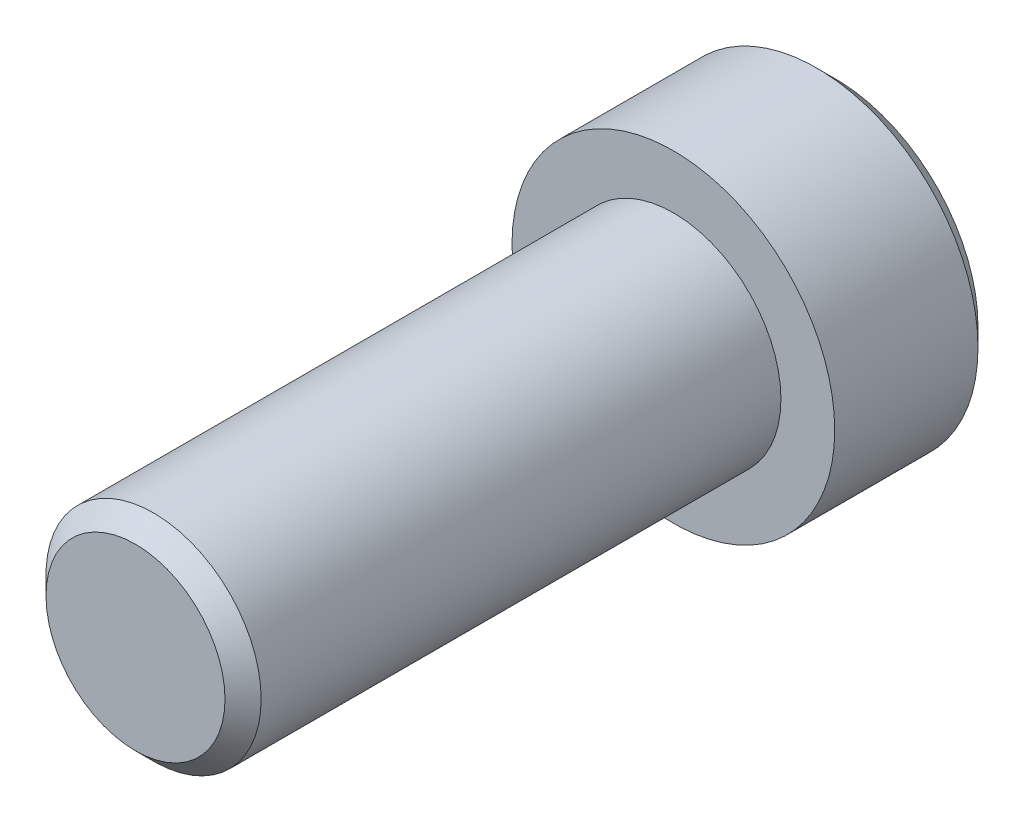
ISO-10303-21;
HEADER;
FILE_DESCRIPTION(('STEP AP214'),'2;1');
FILE_NAME('part.step','',(''),(''),'','','');
FILE_SCHEMA(('AUTOMOTIVE_DESIGN { 1 0 10303 214 1 1 1 1 }'));
ENDSEC;
DATA;
#1=APPLICATION_CONTEXT('core data for automotive mechanical design processes');
#2=APPLICATION_PROTOCOL_DEFINITION('international standard','automotive_design',2000,#1);
#3=PRODUCT_CONTEXT('',#1,'mechanical');
#4=PRODUCT('Part','Part','',(#3));
#5=PRODUCT_RELATED_PRODUCT_CATEGORY('part','',(#4));
#6=PRODUCT_DEFINITION_FORMATION('','',#4);
#7=PRODUCT_DEFINITION_CONTEXT('part definition',#1,'design');
#8=PRODUCT_DEFINITION('design','',#6,#7);
#9=PRODUCT_DEFINITION_SHAPE('','',#8);
#10=(LENGTH_UNIT() NAMED_UNIT(*) SI_UNIT(.MILLI.,.METRE.));
#11=(NAMED_UNIT(*) PLANE_ANGLE_UNIT() SI_UNIT($,.RADIAN.));
#12=(NAMED_UNIT(*) SI_UNIT($,.STERADIAN.) SOLID_ANGLE_UNIT());
#13=UNCERTAINTY_MEASURE_WITH_UNIT(LENGTH_MEASURE(1.E-05),#10,'distance_accuracy_value','');
#14=(GEOMETRIC_REPRESENTATION_CONTEXT(3) GLOBAL_UNCERTAINTY_ASSIGNED_CONTEXT((#13)) GLOBAL_UNIT_ASSIGNED_CONTEXT((#10,
#11,#12)) REPRESENTATION_CONTEXT('',''));
#15=CARTESIAN_POINT('',(0.,0.,0.));
#16=DIRECTION('',(0.,0.,1.));
#17=DIRECTION('',(1.,0.,0.));
#18=AXIS2_PLACEMENT_3D('',#15,#16,#17);
#19=CARTESIAN_POINT('',(0.,0.,15.875));
#20=DIRECTION('',(0.,0.,1.));
#21=DIRECTION('',(1.,0.,0.));
#22=AXIS2_PLACEMENT_3D('',#19,#20,#21);
#23=PLANE('',#22);
#24=CARTESIAN_POINT('',(0.,0.,15.875));
#25=DIRECTION('',(0.,0.,1.));
#26=DIRECTION('',(1.,0.,0.));
#27=AXIS2_PLACEMENT_3D('',#24,#25,#26);
#28=CIRCLE('',#27,2.6416);
#29=CARTESIAN_POINT('',(2.6416,0.,15.875));
#30=VERTEX_POINT('',#29);
#31=EDGE_CURVE('E40',#30,#30,#28,.T.);
#32=ORIENTED_EDGE('',*,*,#31,.T.);
#33=EDGE_LOOP('',(#32));
#34=FACE_BOUND('',#33,.T.);
#35=ADVANCED_FACE('F32',(#34),#23,.T.);
#36=CARTESIAN_POINT('',(0.,0.,15.875));
#37=DIRECTION('',(0.,0.,1.));
#38=DIRECTION('',(1.,0.,0.));
#39=AXIS2_PLACEMENT_3D('',#36,#37,#38);
#40=CYLINDRICAL_SURFACE('',#39,3.175);
#41=CARTESIAN_POINT('',(0.,0.,15.3416));
#42=DIRECTION('',(0.,0.,1.));
#43=DIRECTION('',(1.,0.,0.));
#44=AXIS2_PLACEMENT_3D('',#41,#42,#43);
#45=CIRCLE('',#44,3.175);
#46=CARTESIAN_POINT('',(3.175,0.,15.3416));
#47=VERTEX_POINT('',#46);
#48=EDGE_CURVE('E11',#47,#47,#45,.F.);
#49=ORIENTED_EDGE('',*,*,#48,.T.);
#50=EDGE_LOOP('',(#49));
#51=FACE_BOUND('',#50,.T.);
#52=CARTESIAN_POINT('',(0.,0.,0.));
#53=DIRECTION('',(0.,0.,1.));
#54=DIRECTION('',(1.,0.,0.));
#55=AXIS2_PLACEMENT_3D('',#52,#53,#54);
#56=CIRCLE('',#55,3.175);
#57=CARTESIAN_POINT('',(3.175,0.,0.));
#58=VERTEX_POINT('',#57);
#59=EDGE_CURVE('E142',#58,#58,#56,.T.);
#60=ORIENTED_EDGE('',*,*,#59,.T.);
#61=EDGE_LOOP('',(#60));
#62=FACE_BOUND('',#61,.T.);
#63=ADVANCED_FACE('F163',(#51,#62),#40,.T.);
#64=CARTESIAN_POINT('',(3.175,0.,0.));
#65=DIRECTION('',(0.,0.,1.));
#66=DIRECTION('',(1.,0.,0.));
#67=AXIS2_PLACEMENT_3D('',#64,#65,#66);
#68=PLANE('',#67);
#69=CARTESIAN_POINT('',(0.,0.,0.));
#70=DIRECTION('',(0.,0.,1.));
#71=DIRECTION('',(1.,0.,0.));
#72=AXIS2_PLACEMENT_3D('',#69,#70,#71);
#73=CIRCLE('',#72,4.7625);
#74=CARTESIAN_POINT('',(4.7625,0.,0.));
#75=VERTEX_POINT('',#74);
#76=EDGE_CURVE('E134',#75,#75,#73,.T.);
#77=ORIENTED_EDGE('',*,*,#76,.T.);
#78=EDGE_LOOP('',(#77));
#79=FACE_BOUND('',#78,.T.);
#80=ORIENTED_EDGE('',*,*,#59,.F.);
#81=EDGE_LOOP('',(#80));
#82=FACE_BOUND('',#81,.T.);
#83=ADVANCED_FACE('F168',(#79,#82),#68,.T.);
#84=CARTESIAN_POINT('',(0.,0.,15.875));
#85=DIRECTION('',(0.,0.,1.));
#86=DIRECTION('',(1.,0.,0.));
#87=AXIS2_PLACEMENT_3D('',#84,#85,#86);
#88=CYLINDRICAL_SURFACE('',#87,4.7625);
#89=CARTESIAN_POINT('',(0.,0.,-4.22909999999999));
#90=DIRECTION('',(0.,0.,-1.));
#91=DIRECTION('',(-1.,0.,0.));
#92=AXIS2_PLACEMENT_3D('',#89,#90,#91);
#93=CIRCLE('',#92,4.7625);
#94=CARTESIAN_POINT('',(-4.7625,0.,-4.22909999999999));
#95=VERTEX_POINT('',#94);
#96=EDGE_CURVE('E145',#95,#95,#93,.F.);
#97=ORIENTED_EDGE('',*,*,#96,.T.);
#98=EDGE_LOOP('',(#97));
#99=FACE_BOUND('',#98,.T.);
#100=ORIENTED_EDGE('',*,*,#76,.F.);
#101=EDGE_LOOP('',(#100));
#102=FACE_BOUND('',#101,.T.);
#103=ADVANCED_FACE('F174',(#99,#102),#88,.T.);
#104=CARTESIAN_POINT('',(4.7625,0.,-4.7625));
#105=DIRECTION('',(0.,0.,-1.));
#106=DIRECTION('',(-1.,0.,0.));
#107=AXIS2_PLACEMENT_3D('',#104,#105,#106);
#108=PLANE('',#107);
#109=CARTESIAN_POINT('',(0.,0.,-4.7625));
#110=DIRECTION('',(0.,0.,-1.));
#111=DIRECTION('',(-1.,0.,0.));
#112=AXIS2_PLACEMENT_3D('',#109,#110,#111);
#113=CIRCLE('',#112,4.2291);
#114=CARTESIAN_POINT('',(-4.22909999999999,0.,-4.7625));
#115=VERTEX_POINT('',#114);
#116=EDGE_CURVE('E148',#115,#115,#113,.T.);
#117=ORIENTED_EDGE('',*,*,#116,.T.);
#118=EDGE_LOOP('',(#117));
#119=FACE_BOUND('',#118,.T.);
#120=DIRECTION('',(0.00412520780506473,-0.999991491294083,0.));
#121=VECTOR('',#120,1.);
#122=CARTESIAN_POINT('',(2.37555833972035,1.38462678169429,-4.7625));
#123=LINE('',#122,#121);
#124=CARTESIAN_POINT('',(2.37555833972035,1.38462678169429,-4.7625));
#125=VERTEX_POINT('',#124);
#126=CARTESIAN_POINT('',(2.38690113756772,-1.36498047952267,-4.7625));
#127=VERTEX_POINT('',#126);
#128=EDGE_CURVE('E47',#125,#127,#123,.T.);
#129=ORIENTED_EDGE('',*,*,#128,.F.);
#130=DIRECTION('',(0.868080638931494,-0.496423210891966,0.));
#131=VECTOR('',#130,1.);
#132=CARTESIAN_POINT('',(-0.0113427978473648,2.74960726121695,-4.7625));
#133=LINE('',#132,#131);
#134=CARTESIAN_POINT('',(-0.0113427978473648,2.74960726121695,-4.7625));
#135=VERTEX_POINT('',#134);
#136=EDGE_CURVE('E130',#135,#125,#133,.T.);
#137=ORIENTED_EDGE('',*,*,#136,.F.);
#138=DIRECTION('',(0.863955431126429,0.503568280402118,0.));
#139=VECTOR('',#138,1.);
#140=CARTESIAN_POINT('',(-2.38690113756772,1.36498047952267,-4.7625));
#141=LINE('',#140,#139);
#142=CARTESIAN_POINT('',(-2.38690113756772,1.36498047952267,-4.7625));
#143=VERTEX_POINT('',#142);
#144=EDGE_CURVE('E128',#143,#135,#141,.T.);
#145=ORIENTED_EDGE('',*,*,#144,.F.);
#146=DIRECTION('',(-0.00412520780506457,0.999991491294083,0.));
#147=VECTOR('',#146,1.);
#148=CARTESIAN_POINT('',(-2.37555833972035,-1.38462678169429,-4.7625));
#149=LINE('',#148,#147);
#150=CARTESIAN_POINT('',(-2.37555833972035,-1.38462678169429,-4.7625));
#151=VERTEX_POINT('',#150);
#152=EDGE_CURVE('E95',#151,#143,#149,.T.);
#153=ORIENTED_EDGE('',*,*,#152,.F.);
#154=DIRECTION('',(-0.868080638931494,0.496423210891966,0.));
#155=VECTOR('',#154,1.);
#156=CARTESIAN_POINT('',(0.0113427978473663,-2.74960726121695,-4.7625));
#157=LINE('',#156,#155);
#158=CARTESIAN_POINT('',(0.0113427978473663,-2.74960726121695,-4.7625));
#159=VERTEX_POINT('',#158);
#160=EDGE_CURVE('E124',#159,#151,#157,.T.);
#161=ORIENTED_EDGE('',*,*,#160,.F.);
#162=DIRECTION('',(-0.863955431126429,-0.503568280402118,0.));
#163=VECTOR('',#162,1.);
#164=CARTESIAN_POINT('',(2.38690113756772,-1.36498047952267,-4.7625));
#165=LINE('',#164,#163);
#166=EDGE_CURVE('E121',#127,#159,#165,.T.);
#167=ORIENTED_EDGE('',*,*,#166,.F.);
#168=EDGE_LOOP('',(#129,#137,#145,#153,#161,#167));
#169=FACE_BOUND('',#168,.T.);
#170=ADVANCED_FACE('F178',(#119,#169),#108,.T.);
#171=CARTESIAN_POINT('',(2.37555833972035,1.38462678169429,-0.0635000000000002));
#172=DIRECTION('',(0.999991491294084,0.00412520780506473,0.));
#173=DIRECTION('',(-0.00412520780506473,0.999991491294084,0.));
#174=AXIS2_PLACEMENT_3D('',#171,#172,#173);
#175=PLANE('',#174);
#176=ORIENTED_EDGE('',*,*,#128,.T.);
#177=DIRECTION('',(0.,0.,-1.));
#178=VECTOR('',#177,1.);
#179=CARTESIAN_POINT('',(2.38690113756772,-1.36498047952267,-0.0635000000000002));
#180=LINE('',#179,#178);
#181=CARTESIAN_POINT('',(2.38690113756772,-1.36498047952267,-0.0635000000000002));
#182=VERTEX_POINT('',#181);
#183=EDGE_CURVE('E77',#182,#127,#180,.T.);
#184=ORIENTED_EDGE('',*,*,#183,.F.);
#185=DIRECTION('',(0.00412520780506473,-0.999991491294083,0.));
#186=VECTOR('',#185,1.);
#187=CARTESIAN_POINT('',(2.37555833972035,1.38462678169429,-0.0635000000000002));
#188=LINE('',#187,#186);
#189=CARTESIAN_POINT('',(2.37555833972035,1.38462678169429,-0.0635000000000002));
#190=VERTEX_POINT('',#189);
#191=EDGE_CURVE('E132',#190,#182,#188,.T.);
#192=ORIENTED_EDGE('',*,*,#191,.F.);
#193=DIRECTION('',(0.,0.,-1.));
#194=VECTOR('',#193,1.);
#195=CARTESIAN_POINT('',(2.37555833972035,1.38462678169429,-0.0635000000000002));
#196=LINE('',#195,#194);
#197=EDGE_CURVE('E55',#190,#125,#196,.T.);
#198=ORIENTED_EDGE('',*,*,#197,.T.);
#199=EDGE_LOOP('',(#176,#184,#192,#198));
#200=FACE_BOUND('',#199,.T.);
#201=ADVANCED_FACE('F182',(#200),#175,.F.);
#202=CARTESIAN_POINT('',(-0.0113427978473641,2.74960726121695,-0.0635000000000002));
#203=DIRECTION('',(0.496423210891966,0.868080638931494,0.));
#204=DIRECTION('',(-0.868080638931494,0.496423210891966,0.));
#205=AXIS2_PLACEMENT_3D('',#202,#203,#204);
#206=PLANE('',#205);
#207=ORIENTED_EDGE('',*,*,#136,.T.);
#208=ORIENTED_EDGE('',*,*,#197,.F.);
#209=DIRECTION('',(0.868080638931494,-0.496423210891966,0.));
#210=VECTOR('',#209,1.);
#211=CARTESIAN_POINT('',(-0.0113427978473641,2.74960726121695,-0.0635000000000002));
#212=LINE('',#211,#210);
#213=CARTESIAN_POINT('',(-0.0113427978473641,2.74960726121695,-0.0635000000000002));
#214=VERTEX_POINT('',#213);
#215=EDGE_CURVE('E107',#214,#190,#212,.T.);
#216=ORIENTED_EDGE('',*,*,#215,.F.);
#217=DIRECTION('',(0.,0.,-1.));
#218=VECTOR('',#217,1.);
#219=CARTESIAN_POINT('',(-0.0113427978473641,2.74960726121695,-0.0635000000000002));
#220=LINE('',#219,#218);
#221=EDGE_CURVE('E99',#214,#135,#220,.T.);
#222=ORIENTED_EDGE('',*,*,#221,.T.);
#223=EDGE_LOOP('',(#207,#208,#216,#222));
#224=FACE_BOUND('',#223,.T.);
#225=ADVANCED_FACE('F186',(#224),#206,.F.);
#226=CARTESIAN_POINT('',(-2.38690113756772,1.36498047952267,-0.0635000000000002));
#227=DIRECTION('',(-0.503568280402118,0.863955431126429,0.));
#228=DIRECTION('',(-0.863955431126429,-0.503568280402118,0.));
#229=AXIS2_PLACEMENT_3D('',#226,#227,#228);
#230=PLANE('',#229);
#231=ORIENTED_EDGE('',*,*,#144,.T.);
#232=ORIENTED_EDGE('',*,*,#221,.F.);
#233=DIRECTION('',(0.863955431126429,0.503568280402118,0.));
#234=VECTOR('',#233,1.);
#235=CARTESIAN_POINT('',(-2.38690113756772,1.36498047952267,-0.0635000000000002));
#236=LINE('',#235,#234);
#237=CARTESIAN_POINT('',(-2.38690113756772,1.36498047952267,-0.0635000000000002));
#238=VERTEX_POINT('',#237);
#239=EDGE_CURVE('E103',#238,#214,#236,.T.);
#240=ORIENTED_EDGE('',*,*,#239,.F.);
#241=DIRECTION('',(0.,0.,-1.));
#242=VECTOR('',#241,1.);
#243=CARTESIAN_POINT('',(-2.38690113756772,1.36498047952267,-0.0635000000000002));
#244=LINE('',#243,#242);
#245=EDGE_CURVE('E88',#238,#143,#244,.T.);
#246=ORIENTED_EDGE('',*,*,#245,.T.);
#247=EDGE_LOOP('',(#231,#232,#240,#246));
#248=FACE_BOUND('',#247,.T.);
#249=ADVANCED_FACE('F104',(#248),#230,.F.);
#250=CARTESIAN_POINT('',(-2.37555833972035,-1.38462678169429,-0.0635000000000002));
#251=DIRECTION('',(-0.999991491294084,-0.00412520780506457,0.));
#252=DIRECTION('',(0.00412520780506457,-0.999991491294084,0.));
#253=AXIS2_PLACEMENT_3D('',#250,#251,#252);
#254=PLANE('',#253);
#255=ORIENTED_EDGE('',*,*,#152,.T.);
#256=ORIENTED_EDGE('',*,*,#245,.F.);
#257=DIRECTION('',(-0.00412520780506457,0.999991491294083,0.));
#258=VECTOR('',#257,1.);
#259=CARTESIAN_POINT('',(-2.37555833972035,-1.38462678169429,-0.0635000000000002));
#260=LINE('',#259,#258);
#261=CARTESIAN_POINT('',(-2.37555833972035,-1.38462678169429,-0.0635000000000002));
#262=VERTEX_POINT('',#261);
#263=EDGE_CURVE('E92',#262,#238,#260,.T.);
#264=ORIENTED_EDGE('',*,*,#263,.F.);
#265=DIRECTION('',(0.,0.,-1.));
#266=VECTOR('',#265,1.);
#267=CARTESIAN_POINT('',(-2.37555833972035,-1.38462678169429,-0.0635000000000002));
#268=LINE('',#267,#266);
#269=EDGE_CURVE('E100',#262,#151,#268,.T.);
#270=ORIENTED_EDGE('',*,*,#269,.T.);
#271=EDGE_LOOP('',(#255,#256,#264,#270));
#272=FACE_BOUND('',#271,.T.);
#273=ADVANCED_FACE('F90',(#272),#254,.F.);
#274=CARTESIAN_POINT('',(0.011342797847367,-2.74960726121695,-0.0635000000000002));
#275=DIRECTION('',(-0.496423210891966,-0.868080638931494,0.));
#276=DIRECTION('',(0.868080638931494,-0.496423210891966,0.));
#277=AXIS2_PLACEMENT_3D('',#274,#275,#276);
#278=PLANE('',#277);
#279=ORIENTED_EDGE('',*,*,#160,.T.);
#280=ORIENTED_EDGE('',*,*,#269,.F.);
#281=DIRECTION('',(-0.868080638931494,0.496423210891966,0.));
#282=VECTOR('',#281,1.);
#283=CARTESIAN_POINT('',(0.011342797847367,-2.74960726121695,-0.0635000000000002));
#284=LINE('',#283,#282);
#285=CARTESIAN_POINT('',(0.011342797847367,-2.74960726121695,-0.0635000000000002));
#286=VERTEX_POINT('',#285);
#287=EDGE_CURVE('E113',#286,#262,#284,.T.);
#288=ORIENTED_EDGE('',*,*,#287,.F.);
#289=DIRECTION('',(0.,0.,-1.));
#290=VECTOR('',#289,1.);
#291=CARTESIAN_POINT('',(0.011342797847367,-2.74960726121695,-0.0635000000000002));
#292=LINE('',#291,#290);
#293=EDGE_CURVE('E137',#286,#159,#292,.T.);
#294=ORIENTED_EDGE('',*,*,#293,.T.);
#295=EDGE_LOOP('',(#279,#280,#288,#294));
#296=FACE_BOUND('',#295,.T.);
#297=ADVANCED_FACE('F190',(#296),#278,.F.);
#298=CARTESIAN_POINT('',(2.38690113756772,-1.36498047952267,-0.0635000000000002));
#299=DIRECTION('',(0.503568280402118,-0.863955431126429,0.));
#300=DIRECTION('',(0.863955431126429,0.503568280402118,0.));
#301=AXIS2_PLACEMENT_3D('',#298,#299,#300);
#302=PLANE('',#301);
#303=ORIENTED_EDGE('',*,*,#166,.T.);
#304=ORIENTED_EDGE('',*,*,#293,.F.);
#305=DIRECTION('',(-0.863955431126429,-0.503568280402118,0.));
#306=VECTOR('',#305,1.);
#307=CARTESIAN_POINT('',(2.38690113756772,-1.36498047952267,-0.0635000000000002));
#308=LINE('',#307,#306);
#309=EDGE_CURVE('E115',#182,#286,#308,.T.);
#310=ORIENTED_EDGE('',*,*,#309,.F.);
#311=ORIENTED_EDGE('',*,*,#183,.T.);
#312=EDGE_LOOP('',(#303,#304,#310,#311));
#313=FACE_BOUND('',#312,.T.);
#314=ADVANCED_FACE('F187',(#313),#302,.F.);
#315=CARTESIAN_POINT('',(2.39824393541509,-4.11458774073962,-0.0635000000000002));
#316=DIRECTION('',(0.,0.,-1.));
#317=DIRECTION('',(-1.,0.,0.));
#318=AXIS2_PLACEMENT_3D('',#315,#316,#317);
#319=PLANE('',#318);
#320=ORIENTED_EDGE('',*,*,#191,.T.);
#321=ORIENTED_EDGE('',*,*,#309,.T.);
#322=ORIENTED_EDGE('',*,*,#287,.T.);
#323=ORIENTED_EDGE('',*,*,#263,.T.);
#324=ORIENTED_EDGE('',*,*,#239,.T.);
#325=ORIENTED_EDGE('',*,*,#215,.T.);
#326=EDGE_LOOP('',(#320,#321,#322,#323,#324,#325));
#327=FACE_BOUND('',#326,.T.);
#328=ADVANCED_FACE('F110',(#327),#319,.T.);
#329=CARTESIAN_POINT('',(0.,0.,-4.2291));
#330=DIRECTION('',(0.,0.,1.));
#331=DIRECTION('',(1.,0.,0.));
#332=AXIS2_PLACEMENT_3D('',#329,#330,#331);
#333=CONICAL_SURFACE('',#332,4.7625,0.78539816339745);
#334=ORIENTED_EDGE('',*,*,#116,.F.);
#335=EDGE_LOOP('',(#334));
#336=FACE_BOUND('',#335,.T.);
#337=ORIENTED_EDGE('',*,*,#96,.F.);
#338=EDGE_LOOP('',(#337));
#339=FACE_BOUND('',#338,.T.);
#340=ADVANCED_FACE('F155',(#336,#339),#333,.T.);
#341=CARTESIAN_POINT('',(0.,0.,15.875));
#342=DIRECTION('',(0.,0.,-1.));
#343=DIRECTION('',(-1.,0.,0.));
#344=AXIS2_PLACEMENT_3D('',#341,#342,#343);
#345=CONICAL_SURFACE('',#344,2.6416,0.785398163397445);
#346=ORIENTED_EDGE('',*,*,#48,.F.);
#347=EDGE_LOOP('',(#346));
#348=FACE_BOUND('',#347,.T.);
#349=ORIENTED_EDGE('',*,*,#31,.F.);
#350=EDGE_LOOP('',(#349));
#351=FACE_BOUND('',#350,.T.);
#352=ADVANCED_FACE('F34',(#348,#351),#345,.T.);
#353=CLOSED_SHELL('',(#35,#63,#83,#103,#170,#201,#225,#249,#273,#297,#314,#328,#340,#352));
#354=MANIFOLD_SOLID_BREP('B2',#353);
#355=ADVANCED_BREP_SHAPE_REPRESENTATION('',(#18,#354),#14);
#356=SHAPE_DEFINITION_REPRESENTATION(#9,#355);
ENDSEC;
END-ISO-10303-21;
